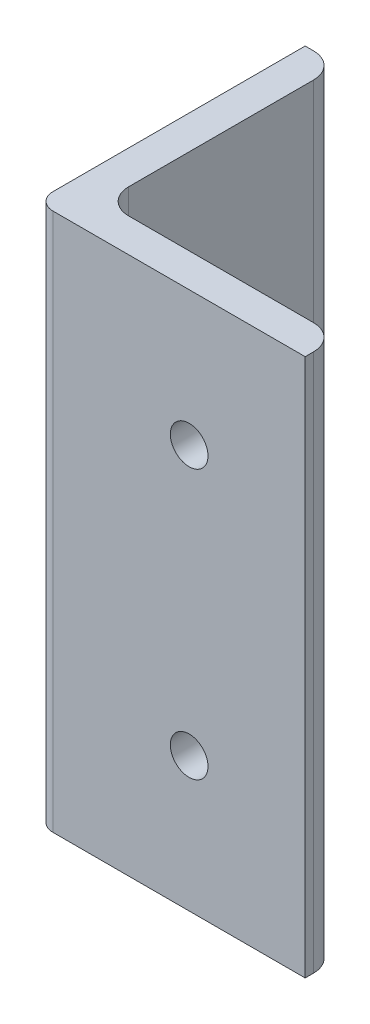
from build123d import *

# Parameters (mm, degrees)
BOSS_EXTRUDE1_DEPTH = 50.8
FILLET1_R           = 2.38125
FILLET2_R           = 1.5875
SKETCH3_R           = 6.35
CUT_EXTRUDE2_DEPTH  = 61.989758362
SKETCH4_R           = 1.778
CUT_EXTRUDE3_DEPTH  = 61.989758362


with BuildPart() as part:
    # Sketch1 → Boss-Extrude1 (new body)
    with BuildSketch(Plane(origin=(0, 0, 0), x_dir=(1, 0, 0), z_dir=(0, 1, 0))):
        Polygon((0, 0), (0, 25.4), (3.175, 25.4), (3.175, 3.175), (25.4, 3.175), (25.4, 0), align=None)
    extrude(amount=BOSS_EXTRUDE1_DEPTH)

    # Fillet1
    fillet1_edges = [part.edges().sort_by_distance(p)[0] for p in [
        (3.175, 25.4, -25.4),
        (3.175, 25.4, -3.175),
        (25.4, 25.4, -3.175),
    ]]
    fillet(fillet1_edges, radius=FILLET1_R)

    # Fillet2
    fillet2_edges = [part.edges().sort_by_distance(p)[0] for p in [
        (0, 25.4, 0),
    ]]
    fillet(fillet2_edges, radius=FILLET2_R)

    # Sketch3 → Cut-Extrude2 (cut, through all)
    with BuildSketch(Plane(origin=(3.175, 0, 0), x_dir=(0, 0, -1), z_dir=(1, 0, 0))):
        with Locations((13.97, 25.4)):
            Circle(SKETCH3_R)
    extrude(amount=-CUT_EXTRUDE2_DEPTH, mode=Mode.SUBTRACT)

    # Sketch4 → Cut-Extrude3 (cut, through all)
    with BuildSketch(Plane(origin=(0, 0, -3.175), x_dir=(-1, 0, 0), z_dir=(0, 0, -1))):
        with Locations((-14.44625, 38.1)):
            Circle(SKETCH4_R)
        with Locations((-14.44625, 12.7)):
            Circle(SKETCH4_R)
    extrude(amount=-CUT_EXTRUDE3_DEPTH, mode=Mode.SUBTRACT)


solid = part.part
